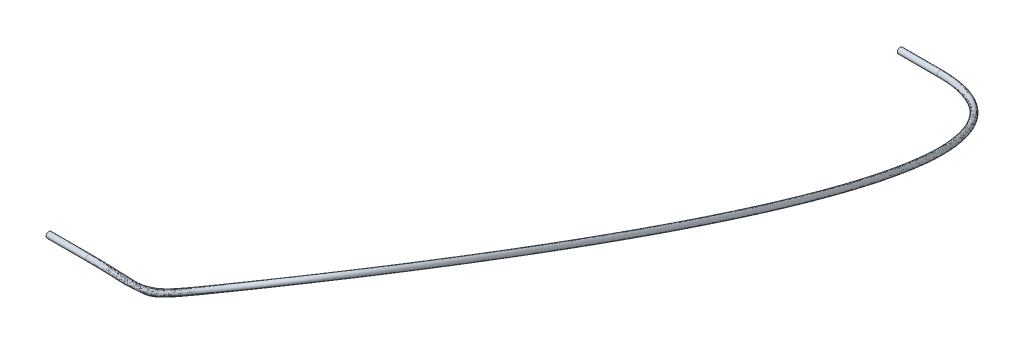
ISO-10303-21;
HEADER;
FILE_DESCRIPTION(('STEP AP214'),'2;1');
FILE_NAME('part.step','',(''),(''),'','','');
FILE_SCHEMA(('AUTOMOTIVE_DESIGN { 1 0 10303 214 1 1 1 1 }'));
ENDSEC;
DATA;
#1=APPLICATION_CONTEXT('core data for automotive mechanical design processes');
#2=APPLICATION_PROTOCOL_DEFINITION('international standard','automotive_design',2000,#1);
#3=PRODUCT_CONTEXT('',#1,'mechanical');
#4=PRODUCT('Part','Part','',(#3));
#5=PRODUCT_RELATED_PRODUCT_CATEGORY('part','',(#4));
#6=PRODUCT_DEFINITION_FORMATION('','',#4);
#7=PRODUCT_DEFINITION_CONTEXT('part definition',#1,'design');
#8=PRODUCT_DEFINITION('design','',#6,#7);
#9=PRODUCT_DEFINITION_SHAPE('','',#8);
#10=(LENGTH_UNIT() NAMED_UNIT(*) SI_UNIT(.MILLI.,.METRE.));
#11=(NAMED_UNIT(*) PLANE_ANGLE_UNIT() SI_UNIT($,.RADIAN.));
#12=(NAMED_UNIT(*) SI_UNIT($,.STERADIAN.) SOLID_ANGLE_UNIT());
#13=UNCERTAINTY_MEASURE_WITH_UNIT(LENGTH_MEASURE(1.E-05),#10,'distance_accuracy_value','');
#14=(GEOMETRIC_REPRESENTATION_CONTEXT(3) GLOBAL_UNCERTAINTY_ASSIGNED_CONTEXT((#13)) GLOBAL_UNIT_ASSIGNED_CONTEXT((#10,
#11,#12)) REPRESENTATION_CONTEXT('',''));
#15=CARTESIAN_POINT('',(0.,0.,0.));
#16=DIRECTION('',(0.,0.,1.));
#17=DIRECTION('',(1.,0.,0.));
#18=AXIS2_PLACEMENT_3D('',#15,#16,#17);
#19=CARTESIAN_POINT('',(257.031510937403,4.77520000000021,-191.910389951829));
#20=DIRECTION('',(-1.,0.,0.));
#21=DIRECTION('',(0.,0.,1.));
#22=AXIS2_PLACEMENT_3D('',#19,#20,#21);
#23=CYLINDRICAL_SURFACE('',#22,0.5);
#24=CARTESIAN_POINT('',(257.031510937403,4.77520000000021,-191.910389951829));
#25=DIRECTION('',(-1.,0.,0.));
#26=DIRECTION('',(0.,-0.453149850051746,0.891434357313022));
#27=AXIS2_PLACEMENT_3D('',#24,#25,#26);
#28=CIRCLE('',#27,0.5);
#29=CARTESIAN_POINT('',(257.031510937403,4.54862507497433,-191.464672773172));
#30=VERTEX_POINT('',#29);
#31=EDGE_CURVE('E50',#30,#30,#28,.T.);
#32=ORIENTED_EDGE('',*,*,#31,.T.);
#33=EDGE_LOOP('',(#32));
#34=FACE_BOUND('',#33,.T.);
#35=CARTESIAN_POINT('',(250.031510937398,4.77520000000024,-191.910389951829));
#36=DIRECTION('',(-1.,0.,0.));
#37=DIRECTION('',(0.,-0.453149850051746,0.891434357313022));
#38=AXIS2_PLACEMENT_3D('',#35,#36,#37);
#39=CIRCLE('',#38,0.5);
#40=CARTESIAN_POINT('',(250.031510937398,4.54862507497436,-191.464672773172));
#41=VERTEX_POINT('',#40);
#42=EDGE_CURVE('E11',#41,#41,#39,.T.);
#43=ORIENTED_EDGE('',*,*,#42,.F.);
#44=EDGE_LOOP('',(#43));
#45=FACE_BOUND('',#44,.T.);
#46=ADVANCED_FACE('F35',(#34,#45),#23,.T.);
#47=CARTESIAN_POINT('',(225.413926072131,19.8627999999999,-74.1065081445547));
#48=DIRECTION('',(-1.,0.,0.));
#49=DIRECTION('',(0.,0.,1.));
#50=AXIS2_PLACEMENT_3D('',#47,#48,#49);
#51=CYLINDRICAL_SURFACE('',#50,0.5);
#52=CARTESIAN_POINT('',(225.413926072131,19.8627999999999,-74.1065081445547));
#53=DIRECTION('',(1.,0.,0.));
#54=DIRECTION('',(0.,0.,-1.));
#55=AXIS2_PLACEMENT_3D('',#52,#53,#54);
#56=CIRCLE('',#55,0.5);
#57=CARTESIAN_POINT('',(225.413926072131,19.8627999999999,-74.6065081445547));
#58=VERTEX_POINT('',#57);
#59=EDGE_CURVE('E41',#58,#58,#56,.T.);
#60=ORIENTED_EDGE('',*,*,#59,.F.);
#61=EDGE_LOOP('',(#60));
#62=FACE_BOUND('',#61,.T.);
#63=CARTESIAN_POINT('',(218.413926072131,19.8627999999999,-74.1065081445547));
#64=DIRECTION('',(1.,0.,0.));
#65=DIRECTION('',(0.,0.,-1.));
#66=AXIS2_PLACEMENT_3D('',#63,#64,#65);
#67=CIRCLE('',#66,0.5);
#68=CARTESIAN_POINT('',(218.413926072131,19.8627999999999,-74.6065081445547));
#69=VERTEX_POINT('',#68);
#70=EDGE_CURVE('E45',#69,#69,#67,.T.);
#71=ORIENTED_EDGE('',*,*,#70,.T.);
#72=EDGE_LOOP('',(#71));
#73=FACE_BOUND('',#72,.T.);
#74=ADVANCED_FACE('F69',(#62,#73),#51,.T.);
#75=CARTESIAN_POINT('',(218.413926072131,19.8627999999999,-74.1065081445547));
#76=DIRECTION('',(1.,0.,0.));
#77=DIRECTION('',(0.,0.,-1.));
#78=AXIS2_PLACEMENT_3D('',#75,#76,#77);
#79=PLANE('',#78);
#80=ORIENTED_EDGE('',*,*,#70,.F.);
#81=EDGE_LOOP('',(#80));
#82=FACE_BOUND('',#81,.T.);
#83=ADVANCED_FACE('F64',(#82),#79,.F.);
#84=CARTESIAN_POINT('',(250.031510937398,4.77520000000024,-191.910389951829));
#85=DIRECTION('',(-1.,0.,0.));
#86=DIRECTION('',(0.,-0.453149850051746,0.891434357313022));
#87=AXIS2_PLACEMENT_3D('',#84,#85,#86);
#88=PLANE('',#87);
#89=ORIENTED_EDGE('',*,*,#42,.T.);
#90=EDGE_LOOP('',(#89));
#91=FACE_BOUND('',#90,.T.);
#92=ADVANCED_FACE('F59',(#91),#88,.T.);
#93=CARTESIAN_POINT('',(225.413926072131,19.8627999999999,-74.6065081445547));
#94=CARTESIAN_POINT('',(225.85186725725,19.8627999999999,-74.6065081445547));
#95=CARTESIAN_POINT('',(226.869999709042,19.9388866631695,-74.5198801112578));
#96=CARTESIAN_POINT('',(228.307097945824,20.2412343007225,-74.1923362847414));
#97=CARTESIAN_POINT('',(229.829161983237,20.7116485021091,-73.6868771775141));
#98=CARTESIAN_POINT('',(232.789348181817,21.8886942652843,-72.4298169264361));
#99=CARTESIAN_POINT('',(238.928313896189,25.3555110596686,-68.8504702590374));
#100=CARTESIAN_POINT('',(250.338788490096,33.2065517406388,-60.1193702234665));
#101=CARTESIAN_POINT('',(260.413626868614,42.2329063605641,-52.5783874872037));
#102=CARTESIAN_POINT('',(269.080012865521,48.5232959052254,-49.3906391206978));
#103=CARTESIAN_POINT('',(271.450908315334,50.1337071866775,-48.8357261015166));
#104=CARTESIAN_POINT('',(273.697438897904,51.5198313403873,-48.6673713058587));
#105=CARTESIAN_POINT('',(275.814336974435,52.6606834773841,-48.9301313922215));
#106=CARTESIAN_POINT('',(277.791713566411,53.5570606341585,-49.5949288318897));
#107=CARTESIAN_POINT('',(279.753238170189,54.262705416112,-50.7169821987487));
#108=CARTESIAN_POINT('',(281.67498875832,54.7329076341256,-52.3775016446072));
#109=CARTESIAN_POINT('',(283.501036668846,54.9221987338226,-54.6163452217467));
#110=CARTESIAN_POINT('',(285.133711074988,54.8272895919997,-57.3036706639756));
#111=CARTESIAN_POINT('',(286.582034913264,54.4683052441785,-60.4087167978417));
#112=CARTESIAN_POINT('',(289.275336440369,53.1682285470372,-67.8598051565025));
#113=CARTESIAN_POINT('',(291.538134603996,49.4972524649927,-81.0540158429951));
#114=CARTESIAN_POINT('',(292.207090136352,42.9885401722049,-100.011124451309));
#115=CARTESIAN_POINT('',(290.832418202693,35.0871532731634,-120.625714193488));
#116=CARTESIAN_POINT('',(287.5768119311,26.6630850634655,-141.223193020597));
#117=CARTESIAN_POINT('',(282.61237160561,18.5748646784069,-160.150171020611));
#118=CARTESIAN_POINT('',(276.965091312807,12.4561964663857,-174.017100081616));
#119=CARTESIAN_POINT('',(271.380289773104,8.52273922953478,-182.765003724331));
#120=CARTESIAN_POINT('',(267.641361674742,6.6507519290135,-186.883566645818));
#121=CARTESIAN_POINT('',(264.439404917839,5.56523613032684,-189.255336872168));
#122=CARTESIAN_POINT('',(262.052780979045,4.98765972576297,-190.512187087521));
#123=CARTESIAN_POINT('',(259.561532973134,4.62870079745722,-191.290050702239));
#124=CARTESIAN_POINT('',(257.894549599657,4.54862507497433,-191.464672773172));
#125=CARTESIAN_POINT('',(257.031510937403,4.54862507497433,-191.464672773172));
#126=CARTESIAN_POINT('',(225.413926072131,20.8627999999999,-74.6065081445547));
#127=CARTESIAN_POINT('',(225.776901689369,20.8627999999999,-74.6065081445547));
#128=CARTESIAN_POINT('',(226.730290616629,20.9298409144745,-74.5380788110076));
#129=CARTESIAN_POINT('',(228.057371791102,21.210389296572,-74.2415065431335));
#130=CARTESIAN_POINT('',(229.517803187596,21.658929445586,-73.7715811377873));
#131=CARTESIAN_POINT('',(232.39825643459,22.7971907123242,-72.5833578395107));
#132=CARTESIAN_POINT('',(238.453235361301,26.2689993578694,-69.102189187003));
#133=CARTESIAN_POINT('',(250.948948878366,33.5093649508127,-61.326142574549));
#134=CARTESIAN_POINT('',(260.500907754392,42.8372138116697,-53.3851823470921));
#135=CARTESIAN_POINT('',(269.071793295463,48.9282515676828,-50.3065873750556));
#136=CARTESIAN_POINT('',(271.380246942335,50.4782810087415,-49.7737440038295));
#137=CARTESIAN_POINT('',(273.524641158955,51.7898285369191,-49.6181215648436));
#138=CARTESIAN_POINT('',(275.50575345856,52.8626725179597,-49.8642151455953));
#139=CARTESIAN_POINT('',(277.337765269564,53.6948479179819,-50.480526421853));
#140=CARTESIAN_POINT('',(279.151052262,54.3504989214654,-51.517129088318));
#141=CARTESIAN_POINT('',(280.944908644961,54.7937247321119,-53.0647954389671));
#142=CARTESIAN_POINT('',(282.678441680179,54.9788967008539,-55.1871585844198));
#143=CARTESIAN_POINT('',(284.2517133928,54.8935815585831,-57.773991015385));
#144=CARTESIAN_POINT('',(285.662717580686,54.5510022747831,-60.7963911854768));
#145=CARTESIAN_POINT('',(288.307782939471,53.2928869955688,-68.106242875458));
#146=CARTESIAN_POINT('',(290.567407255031,49.6903670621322,-81.2030252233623));
#147=CARTESIAN_POINT('',(291.250486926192,43.2770026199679,-100.096236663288));
#148=CARTESIAN_POINT('',(289.914543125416,35.4862431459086,-120.681620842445));
#149=CARTESIAN_POINT('',(286.712621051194,27.1699665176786,-141.259065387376));
#150=CARTESIAN_POINT('',(281.808535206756,19.172746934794,-160.152103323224));
#151=CARTESIAN_POINT('',(276.217629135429,13.1225394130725,-173.958281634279));
#152=CARTESIAN_POINT('',(270.713923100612,9.25558311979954,-182.605934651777));
#153=CARTESIAN_POINT('',(267.066036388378,7.4334058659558,-186.635372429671));
#154=CARTESIAN_POINT('',(263.97768478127,6.392839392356,-188.921212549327));
#155=CARTESIAN_POINT('',(261.73364580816,5.84694844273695,-190.116938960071));
#156=CARTESIAN_POINT('',(259.322058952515,5.51268791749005,-190.846660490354));
#157=CARTESIAN_POINT('',(257.963077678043,5.44005943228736,-191.011522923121));
#158=CARTESIAN_POINT('',(257.031510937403,5.44005943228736,-191.011522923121));
#159=CARTESIAN_POINT('',(225.413926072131,20.8627999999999,-73.6065081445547));
#160=CARTESIAN_POINT('',(225.776901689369,20.8627999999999,-73.6065081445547));
#161=CARTESIAN_POINT('',(226.537239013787,20.9285266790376,-73.5486016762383));
#162=CARTESIAN_POINT('',(227.795890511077,21.1932334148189,-73.2775590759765));
#163=CARTESIAN_POINT('',(229.165991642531,21.6293846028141,-72.8336825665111));
#164=CARTESIAN_POINT('',(231.943890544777,22.7571953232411,-71.6941625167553));
#165=CARTESIAN_POINT('',(237.874587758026,26.2137430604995,-68.2136816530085));
#166=CARTESIAN_POINT('',(250.14959763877,34.6382932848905,-61.4537578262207));
#167=CARTESIAN_POINT('',(259.757397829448,43.4025641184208,-53.0107808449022));
#168=CARTESIAN_POINT('',(268.461916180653,49.6518270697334,-49.9796241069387));
#169=CARTESIAN_POINT('',(270.82516435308,51.2446741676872,-49.4472613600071));
#170=CARTESIAN_POINT('',(273.052252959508,52.6117442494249,-49.2933921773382));
#171=CARTESIAN_POINT('',(275.138890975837,53.7398736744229,-49.5461729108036));
#172=CARTESIAN_POINT('',(277.085462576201,54.6235722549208,-50.1984178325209));
#173=CARTESIAN_POINT('',(279.016048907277,55.3203335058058,-51.2987697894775));
#174=CARTESIAN_POINT('',(280.912319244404,55.7871407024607,-52.9319019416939));
#175=CARTESIAN_POINT('',(282.721817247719,55.9787126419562,-55.1425369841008));
#176=CARTESIAN_POINT('',(284.346451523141,55.889675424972,-57.8054119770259));
#177=CARTESIAN_POINT('',(285.793045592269,55.5387367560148,-60.8901847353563));
#178=CARTESIAN_POINT('',(288.493158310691,54.2589230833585,-68.3064748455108));
#179=CARTESIAN_POINT('',(290.795935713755,50.6249734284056,-81.4779028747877));
#180=CARTESIAN_POINT('',(291.552704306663,44.1725481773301,-100.429666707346));
#181=CARTESIAN_POINT('',(290.304806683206,36.3289842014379,-121.058259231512));
#182=CARTESIAN_POINT('',(287.187283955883,27.9464084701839,-141.678844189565));
#183=CARTESIAN_POINT('',(282.336930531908,19.879044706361,-160.626084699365));
#184=CARTESIAN_POINT('',(276.758003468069,13.7691387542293,-174.500864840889));
#185=CARTESIAN_POINT('',(271.216408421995,9.84425083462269,-183.241839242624));
#186=CARTESIAN_POINT('',(267.509459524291,7.97952369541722,-187.349244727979));
#187=CARTESIAN_POINT('',(264.333640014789,6.9011230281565,-189.708250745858));
#188=CARTESIAN_POINT('',(261.98957177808,6.32850102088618,-190.956049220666));
#189=CARTESIAN_POINT('',(259.484282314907,5.97347270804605,-191.72657572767));
#190=CARTESIAN_POINT('',(257.963077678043,5.8932092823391,-191.902957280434));
#191=CARTESIAN_POINT('',(257.031510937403,5.8932092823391,-191.902957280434));
#192=CARTESIAN_POINT('',(225.413926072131,19.8627999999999,-73.6065081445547));
#193=CARTESIAN_POINT('',(225.814384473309,19.8627999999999,-73.6065081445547));
#194=CARTESIAN_POINT('',(226.69614432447,19.9375724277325,-73.5304029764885));
#195=CARTESIAN_POINT('',(228.039632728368,20.2240784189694,-73.2283888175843));
#196=CARTESIAN_POINT('',(229.479151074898,20.6821036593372,-72.748978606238));
#197=CARTESIAN_POINT('',(232.33287800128,21.8486988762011,-71.5406216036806));
#198=CARTESIAN_POINT('',(238.351565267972,25.3002547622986,-67.9619627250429));
#199=CARTESIAN_POINT('',(249.538107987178,34.3354800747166,-60.2469854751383));
#200=CARTESIAN_POINT('',(259.670161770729,42.7982566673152,-52.2039859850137));
#201=CARTESIAN_POINT('',(268.470133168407,49.2468714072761,-49.0636758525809));
#202=CARTESIAN_POINT('',(270.895826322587,50.9001003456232,-48.5092434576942));
#203=CARTESIAN_POINT('',(273.225050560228,52.3417470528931,-48.3426419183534));
#204=CARTESIAN_POINT('',(275.447474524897,53.5378846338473,-48.6120891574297));
#205=CARTESIAN_POINT('',(277.539410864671,54.4857849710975,-49.3128202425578));
#206=CARTESIAN_POINT('',(279.618234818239,55.2325400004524,-50.498622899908));
#207=CARTESIAN_POINT('',(281.64239935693,55.7263236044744,-52.2446081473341));
#208=CARTESIAN_POINT('',(283.544412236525,55.9220146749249,-54.5717236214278));
#209=CARTESIAN_POINT('',(285.22844920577,55.8233834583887,-57.3350916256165));
#210=CARTESIAN_POINT('',(286.712362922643,55.4560397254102,-60.5025103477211));
#211=CARTESIAN_POINT('',(289.460711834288,54.1342646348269,-68.0600371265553));
#212=CARTESIAN_POINT('',(291.766662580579,50.4318588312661,-81.3288934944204));
#213=CARTESIAN_POINT('',(292.50930974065,43.8840857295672,-100.344554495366));
#214=CARTESIAN_POINT('',(291.222672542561,35.9298943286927,-121.002352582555));
#215=CARTESIAN_POINT('',(288.05150889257,27.4395270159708,-141.642971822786));
#216=CARTESIAN_POINT('',(283.140654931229,19.2811624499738,-160.624152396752));
#217=CARTESIAN_POINT('',(277.505735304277,13.1027958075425,-174.559683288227));
#218=CARTESIAN_POINT('',(271.882410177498,9.1114069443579,-183.400908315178));
#219=CARTESIAN_POINT('',(268.085690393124,7.19686975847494,-187.597438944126));
#220=CARTESIAN_POINT('',(264.79402151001,6.07351976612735,-190.042375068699));
#221=CARTESIAN_POINT('',(262.313320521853,5.46921230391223,-191.351297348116));
#222=CARTESIAN_POINT('',(259.707593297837,5.0894855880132,-192.169965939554));
#223=CARTESIAN_POINT('',(257.92881363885,5.00177492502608,-192.356107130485));
#224=CARTESIAN_POINT('',(257.031510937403,5.00177492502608,-192.356107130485));
#225=CARTESIAN_POINT('',(225.413926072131,18.8627999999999,-73.6065081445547));
#226=CARTESIAN_POINT('',(225.85186725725,18.8627999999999,-73.6065081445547));
#227=CARTESIAN_POINT('',(226.855049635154,18.9466181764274,-73.5122042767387));
#228=CARTESIAN_POINT('',(228.283374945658,19.2549234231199,-73.1792185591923));
#229=CARTESIAN_POINT('',(229.792310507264,19.7348227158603,-72.6642746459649));
#230=CARTESIAN_POINT('',(232.721865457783,20.9402024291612,-71.387080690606));
#231=CARTESIAN_POINT('',(238.828542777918,24.3867664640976,-67.7102437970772));
#232=CARTESIAN_POINT('',(248.926618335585,34.0326668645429,-59.0402131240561));
#233=CARTESIAN_POINT('',(259.58292571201,42.1939492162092,-51.3971911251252));
#234=CARTESIAN_POINT('',(268.478350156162,48.8419157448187,-48.1477275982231));
#235=CARTESIAN_POINT('',(270.966488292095,50.5555265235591,-47.5712255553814));
#236=CARTESIAN_POINT('',(273.397848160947,52.0717498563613,-47.3918916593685));
#237=CARTESIAN_POINT('',(275.756058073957,53.3358955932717,-47.6780054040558));
#238=CARTESIAN_POINT('',(277.993359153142,54.3479976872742,-48.4272226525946));
#239=CARTESIAN_POINT('',(280.220420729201,55.144746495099,-49.6984760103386));
#240=CARTESIAN_POINT('',(282.372479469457,55.6655065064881,-51.5573143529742));
#241=CARTESIAN_POINT('',(284.36700722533,55.8653167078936,-54.0009102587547));
#242=CARTESIAN_POINT('',(286.110446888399,55.7570914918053,-56.8647712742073));
#243=CARTESIAN_POINT('',(287.631680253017,55.3733426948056,-60.1148359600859));
#244=CARTESIAN_POINT('',(290.428265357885,54.0096061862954,-67.8135994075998));
#245=CARTESIAN_POINT('',(292.737389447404,50.2387442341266,-81.179884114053));
#246=CARTESIAN_POINT('',(293.465915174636,43.5956232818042,-100.259442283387));
#247=CARTESIAN_POINT('',(292.140538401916,35.5308044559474,-120.946445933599));
#248=CARTESIAN_POINT('',(288.915733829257,26.9326455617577,-141.607099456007));
#249=CARTESIAN_POINT('',(283.94437933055,18.6832801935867,-160.622220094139));
#250=CARTESIAN_POINT('',(278.253467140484,12.4364528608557,-174.618501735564));
#251=CARTESIAN_POINT('',(272.548411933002,8.37856305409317,-183.559977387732));
#252=CARTESIAN_POINT('',(268.661921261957,6.41421582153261,-187.845633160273));
#253=CARTESIAN_POINT('',(265.254403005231,5.24591650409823,-190.376499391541));
#254=CARTESIAN_POINT('',(262.637069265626,4.60992358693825,-191.746545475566));
#255=CARTESIAN_POINT('',(259.930904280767,4.20549846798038,-192.613356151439));
#256=CARTESIAN_POINT('',(257.894549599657,4.11034056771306,-192.809256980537));
#257=CARTESIAN_POINT('',(257.031510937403,4.11034056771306,-192.809256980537));
#258=CARTESIAN_POINT('',(225.413926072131,18.8627999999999,-74.6065081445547));
#259=CARTESIAN_POINT('',(225.92683282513,18.8627999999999,-74.6065081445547));
#260=CARTESIAN_POINT('',(227.009708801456,18.9479324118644,-74.501681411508));
#261=CARTESIAN_POINT('',(228.556824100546,19.272079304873,-74.1431660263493));
#262=CARTESIAN_POINT('',(230.140520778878,19.7643675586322,-73.6021732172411));
#263=CARTESIAN_POINT('',(233.180439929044,20.9801978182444,-72.2762760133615));
#264=CARTESIAN_POINT('',(239.403392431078,24.4420227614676,-68.5987513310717));
#265=CARTESIAN_POINT('',(249.728628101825,32.903738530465,-58.9125978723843));
#266=CARTESIAN_POINT('',(260.326345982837,41.6285989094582,-51.7715926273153));
#267=CARTESIAN_POINT('',(269.08823243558,48.118340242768,-48.47469086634));
#268=CARTESIAN_POINT('',(271.521569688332,49.7891333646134,-47.8977081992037));
#269=CARTESIAN_POINT('',(273.870236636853,51.2498341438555,-47.7166210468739));
#270=CARTESIAN_POINT('',(276.122920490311,52.4586944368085,-47.9960476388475));
#271=CARTESIAN_POINT('',(278.245661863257,53.4192733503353,-48.7093312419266));
#272=CARTESIAN_POINT('',(280.355424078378,54.1749119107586,-49.9168353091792));
#273=CARTESIAN_POINT('',(282.405068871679,54.6720905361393,-51.6902078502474));
#274=CARTESIAN_POINT('',(284.323631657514,54.8655007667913,-54.0455318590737));
#275=CARTESIAN_POINT('',(286.015708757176,54.7609976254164,-56.8333503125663));
#276=CARTESIAN_POINT('',(287.501352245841,54.3856082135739,-60.0210424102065));
#277=CARTESIAN_POINT('',(290.242889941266,53.0435700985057,-67.6133674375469));
#278=CARTESIAN_POINT('',(292.50886195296,49.3041378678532,-80.9050064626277));
#279=CARTESIAN_POINT('',(293.163693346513,42.7000777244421,-99.9260122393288));
#280=CARTESIAN_POINT('',(291.75029327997,34.6880634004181,-120.569807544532));
#281=CARTESIAN_POINT('',(288.441002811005,26.1562036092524,-141.187320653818));
#282=CARTESIAN_POINT('',(283.416208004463,17.9769824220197,-160.148238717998));
#283=CARTESIAN_POINT('',(277.712553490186,11.7898535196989,-174.075918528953));
#284=CARTESIAN_POINT('',(272.046656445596,7.78989533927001,-182.924072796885));
#285=CARTESIAN_POINT('',(268.216686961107,5.8680979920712,-187.131760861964));
#286=CARTESIAN_POINT('',(264.901125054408,4.73763286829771,-189.589461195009));
#287=CARTESIAN_POINT('',(262.37191614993,4.128371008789,-190.90743521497));
#288=CARTESIAN_POINT('',(259.801006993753,3.74471367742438,-191.733440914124));
#289=CARTESIAN_POINT('',(257.826021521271,3.65719071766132,-191.917822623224));
#290=CARTESIAN_POINT('',(257.031510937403,3.65719071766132,-191.917822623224));
#291=CARTESIAN_POINT('',(225.413926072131,19.8627999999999,-74.6065081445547));
#292=CARTESIAN_POINT('',(225.85186725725,19.8627999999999,-74.6065081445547));
#293=CARTESIAN_POINT('',(226.869999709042,19.9388866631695,-74.5198801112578));
#294=CARTESIAN_POINT('',(228.307097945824,20.2412343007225,-74.1923362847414));
#295=CARTESIAN_POINT('',(229.829161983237,20.7116485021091,-73.6868771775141));
#296=CARTESIAN_POINT('',(232.789348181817,21.8886942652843,-72.4298169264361));
#297=CARTESIAN_POINT('',(238.928313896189,25.3555110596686,-68.8504702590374));
#298=CARTESIAN_POINT('',(250.338788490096,33.2065517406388,-60.1193702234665));
#299=CARTESIAN_POINT('',(260.413626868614,42.2329063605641,-52.5783874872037));
#300=CARTESIAN_POINT('',(269.080012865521,48.5232959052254,-49.3906391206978));
#301=CARTESIAN_POINT('',(271.450908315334,50.1337071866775,-48.8357261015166));
#302=CARTESIAN_POINT('',(273.697438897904,51.5198313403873,-48.6673713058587));
#303=CARTESIAN_POINT('',(275.814336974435,52.6606834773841,-48.9301313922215));
#304=CARTESIAN_POINT('',(277.791713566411,53.5570606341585,-49.5949288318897));
#305=CARTESIAN_POINT('',(279.753238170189,54.262705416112,-50.7169821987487));
#306=CARTESIAN_POINT('',(281.67498875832,54.7329076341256,-52.3775016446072));
#307=CARTESIAN_POINT('',(283.501036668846,54.9221987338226,-54.6163452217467));
#308=CARTESIAN_POINT('',(285.133711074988,54.8272895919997,-57.3036706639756));
#309=CARTESIAN_POINT('',(286.582034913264,54.4683052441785,-60.4087167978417));
#310=CARTESIAN_POINT('',(289.275336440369,53.1682285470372,-67.8598051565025));
#311=CARTESIAN_POINT('',(291.538134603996,49.4972524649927,-81.0540158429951));
#312=CARTESIAN_POINT('',(292.207090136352,42.9885401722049,-100.011124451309));
#313=CARTESIAN_POINT('',(290.832418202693,35.0871532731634,-120.625714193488));
#314=CARTESIAN_POINT('',(287.5768119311,26.6630850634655,-141.223193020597));
#315=CARTESIAN_POINT('',(282.61237160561,18.5748646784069,-160.150171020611));
#316=CARTESIAN_POINT('',(276.965091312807,12.4561964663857,-174.017100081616));
#317=CARTESIAN_POINT('',(271.380289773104,8.52273922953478,-182.765003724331));
#318=CARTESIAN_POINT('',(267.641361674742,6.6507519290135,-186.883566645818));
#319=CARTESIAN_POINT('',(264.439404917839,5.56523613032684,-189.255336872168));
#320=CARTESIAN_POINT('',(262.052780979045,4.98765972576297,-190.512187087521));
#321=CARTESIAN_POINT('',(259.561532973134,4.62870079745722,-191.290050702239));
#322=CARTESIAN_POINT('',(257.894549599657,4.54862507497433,-191.464672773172));
#323=CARTESIAN_POINT('',(257.031510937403,4.54862507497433,-191.464672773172));
#324=(BOUNDED_SURFACE() B_SPLINE_SURFACE(3,3,((#93,#94,#95,#96,#97,#98,#99,#100,#101,#102,#103,
#104,#105,#106,#107,#108,#109,#110,#111,#112,#113,#114,#115,#116,#117,#118,#119,#120,#121,#122,
#123,#124,#125),(#126,#127,#128,#129,#130,#131,#132,#133,#134,#135,#136,#137,#138,#139,#140,
#141,#142,#143,#144,#145,#146,#147,#148,#149,#150,#151,#152,#153,#154,#155,#156,#157,#158),
(#159,#160,#161,#162,#163,#164,#165,#166,#167,#168,#169,#170,#171,#172,#173,#174,#175,#176,#177,
#178,#179,#180,#181,#182,#183,#184,#185,#186,#187,#188,#189,#190,#191),(#192,#193,#194,#195,
#196,#197,#198,#199,#200,#201,#202,#203,#204,#205,#206,#207,#208,#209,#210,#211,#212,#213,#214,
#215,#216,#217,#218,#219,#220,#221,#222,#223,#224),(#225,#226,#227,#228,#229,#230,#231,#232,
#233,#234,#235,#236,#237,#238,#239,#240,#241,#242,#243,#244,#245,#246,#247,#248,#249,#250,#251,
#252,#253,#254,#255,#256,#257),(#258,#259,#260,#261,#262,#263,#264,#265,#266,#267,#268,#269,
#270,#271,#272,#273,#274,#275,#276,#277,#278,#279,#280,#281,#282,#283,#284,#285,#286,#287,#288,
#289,#290),(#291,#292,#293,#294,#295,#296,#297,#298,#299,#300,#301,#302,#303,#304,#305,#306,
#307,#308,#309,#310,#311,#312,#313,#314,#315,#316,#317,#318,#319,#320,#321,#322,#323)),
.UNSPECIFIED.,.T.,.F.,.F.) B_SPLINE_SURFACE_WITH_KNOTS((4,3,4),(4,1,1,1,1,1,1,1,1,1,1,1,1,1,1,1,
1,1,1,1,1,1,1,1,1,1,1,1,1,1,4),(0.,0.5,1.),(0.,0.00560045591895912,0.011781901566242,
0.0186486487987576,0.0262384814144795,0.0545772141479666,0.117815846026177,0.234256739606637,
0.247884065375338,0.260326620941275,0.271578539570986,0.281833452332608,0.29146664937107,
0.300880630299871,0.312405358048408,0.324671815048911,0.338025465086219,0.352660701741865,
0.368661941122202,0.440366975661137,0.52738871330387,0.623252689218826,0.720747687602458,
0.812578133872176,0.891876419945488,0.925129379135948,0.953651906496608,0.966272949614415,
0.977990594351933,0.989094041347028,1.),
.UNSPECIFIED.) GEOMETRIC_REPRESENTATION_ITEM() RATIONAL_B_SPLINE_SURFACE(((1.,1.,1.,1.,1.,1.,1.,
1.,1.,1.,1.,1.,1.,1.,1.,1.,1.,1.,1.,1.,1.,1.,1.,1.,1.,1.,1.,1.,1.,1.,1.,1.,1.),
(0.333333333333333,0.333333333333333,0.333333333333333,0.333333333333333,0.333333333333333,
0.333333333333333,0.333333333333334,0.333333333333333,0.333333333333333,0.333333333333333,
0.333333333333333,0.333333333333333,0.333333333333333,0.333333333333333,0.333333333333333,
0.333333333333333,0.333333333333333,0.333333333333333,0.333333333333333,0.333333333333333,
0.333333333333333,0.333333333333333,0.333333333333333,0.333333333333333,0.333333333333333,
0.333333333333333,0.333333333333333,0.333333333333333,0.333333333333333,0.333333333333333,
0.333333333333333,0.333333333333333,0.333333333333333),(0.333333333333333,0.333333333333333,
0.333333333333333,0.333333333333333,0.333333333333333,0.333333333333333,0.333333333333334,
0.333333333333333,0.333333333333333,0.333333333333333,0.333333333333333,0.333333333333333,
0.333333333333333,0.333333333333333,0.333333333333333,0.333333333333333,0.333333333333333,
0.333333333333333,0.333333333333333,0.333333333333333,0.333333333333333,0.333333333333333,
0.333333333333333,0.333333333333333,0.333333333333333,0.333333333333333,0.333333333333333,
0.333333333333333,0.333333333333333,0.333333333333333,0.333333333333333,0.333333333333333,
0.333333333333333),(1.,1.,1.,1.,1.,1.,1.,1.,1.,1.,1.,1.,1.,1.,1.,1.,1.,1.,1.,1.,1.,1.,1.,1.,1.,
1.,1.,1.,1.,1.,1.,1.,1.),(0.333333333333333,0.333333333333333,0.333333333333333,
0.333333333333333,0.333333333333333,0.333333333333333,0.333333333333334,0.333333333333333,
0.333333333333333,0.333333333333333,0.333333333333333,0.333333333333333,0.333333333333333,
0.333333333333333,0.333333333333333,0.333333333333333,0.333333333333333,0.333333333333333,
0.333333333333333,0.333333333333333,0.333333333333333,0.333333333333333,0.333333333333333,
0.333333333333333,0.333333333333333,0.333333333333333,0.333333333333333,0.333333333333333,
0.333333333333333,0.333333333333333,0.333333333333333,0.333333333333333,0.333333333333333),
(0.333333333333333,0.333333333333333,0.333333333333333,0.333333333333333,0.333333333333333,
0.333333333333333,0.333333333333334,0.333333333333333,0.333333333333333,0.333333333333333,
0.333333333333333,0.333333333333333,0.333333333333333,0.333333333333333,0.333333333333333,
0.333333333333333,0.333333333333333,0.333333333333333,0.333333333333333,0.333333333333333,
0.333333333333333,0.333333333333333,0.333333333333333,0.333333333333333,0.333333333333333,
0.333333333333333,0.333333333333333,0.333333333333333,0.333333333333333,0.333333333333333,
0.333333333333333,0.333333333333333,0.333333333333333),(1.,1.,1.,1.,1.,1.,1.,1.,1.,1.,1.,1.,1.,
1.,1.,1.,1.,1.,1.,1.,1.,1.,1.,1.,1.,1.,1.,1.,1.,1.,1.,1.,1.))) REPRESENTATION_ITEM('') SURFACE());
#325=ORIENTED_EDGE('',*,*,#59,.T.);
#326=EDGE_LOOP('',(#325));
#327=FACE_BOUND('',#326,.T.);
#328=ORIENTED_EDGE('',*,*,#31,.F.);
#329=EDGE_LOOP('',(#328));
#330=FACE_BOUND('',#329,.T.);
#331=ADVANCED_FACE('F57',(#327,#330),#324,.T.);
#332=CLOSED_SHELL('',(#46,#74,#83,#92,#331));
#333=MANIFOLD_SOLID_BREP('B2',#332);
#334=ADVANCED_BREP_SHAPE_REPRESENTATION('',(#18,#333),#14);
#335=SHAPE_DEFINITION_REPRESENTATION(#9,#334);
ENDSEC;
END-ISO-10303-21;
